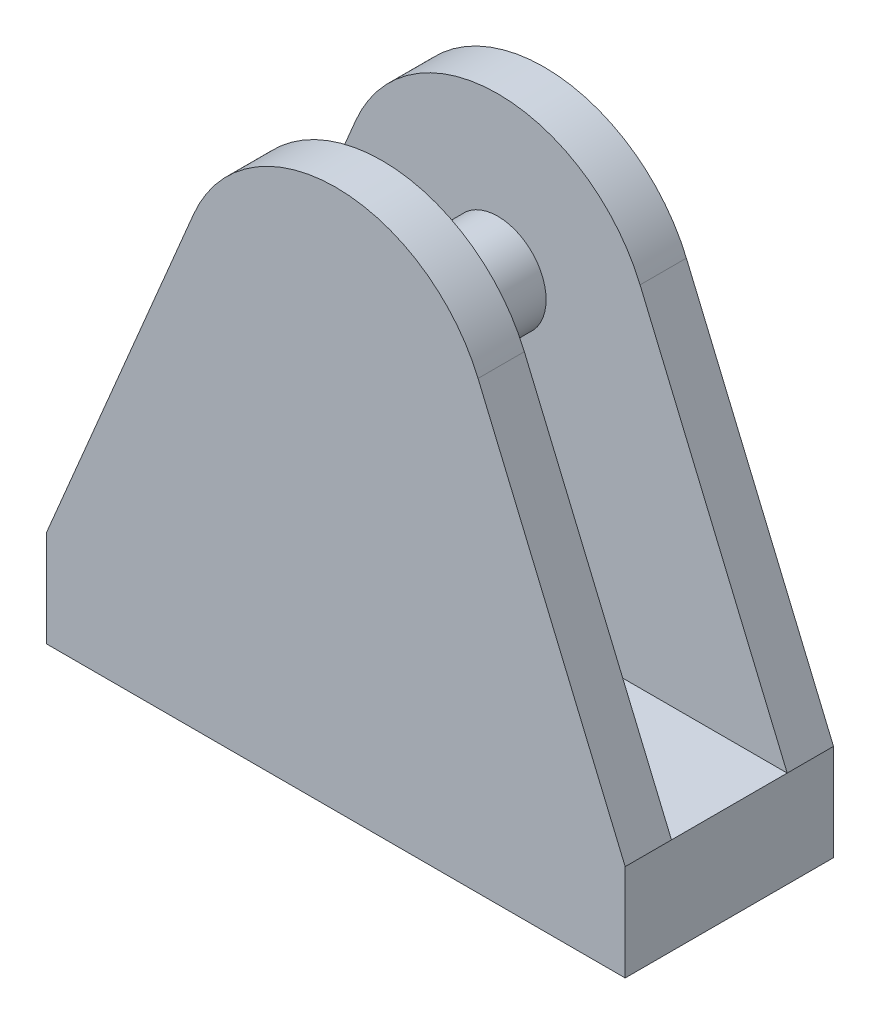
from build123d import *

# Parameters (mm, degrees)
BOSS_EXTRUDE1_DEPTH = 54
SKETCH2_W           = 30
SKETCH2_H           = 163.908127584
CUT_EXTRUDE1_DEPTH  = 213.169743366
BOSS_EXTRUDE2_REACH = 214.17
SKETCH4_R           = 12.5


with BuildPart() as part:
    # Sketch1 → Boss-Extrude1 (new body)
    with BuildSketch(Plane.XY):
        with BuildLine():
            Line((0, 0), (150, 0))
            Line((150, 0), (150, 25))
            Line((150, 25), (111.862510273, 115.529176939))
            ThreePointArc((111.862510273, 115.529176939), (75, 140), (38.137489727, 115.529176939))
            Line((38.137489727, 115.529176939), (0, 25))
            Line((0, 25), (0, 0))
        make_face()
    extrude(amount=BOSS_EXTRUDE1_DEPTH)

    # Sketch2 → Cut-Extrude1 (cut, through all)
    with BuildSketch(Plane(origin=(150, 0, 0), x_dir=(0, 0, -1), z_dir=(1, 0, 0))):
        with Locations((-27, 106.954063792)):
            Rectangle(SKETCH2_W, SKETCH2_H)
    extrude(amount=-CUT_EXTRUDE1_DEPTH, mode=Mode.SUBTRACT)

    # Sketch4 → Boss-Extrude2 (add, up to next)
    with BuildSketch(Plane.XY.offset(54), mode=Mode.PRIVATE) as boss_extrude2_sk1:
        with Locations((75, 100)):
            Circle(SKETCH4_R)
    boss_extrude2_tool1 = extrude(boss_extrude2_sk1.sketch, amount=-BOSS_EXTRUDE2_REACH, mode=Mode.PRIVATE) - part.part
    add(boss_extrude2_tool1.solids().sort_by_distance((75, 100, 54))[0])


solid = part.part
